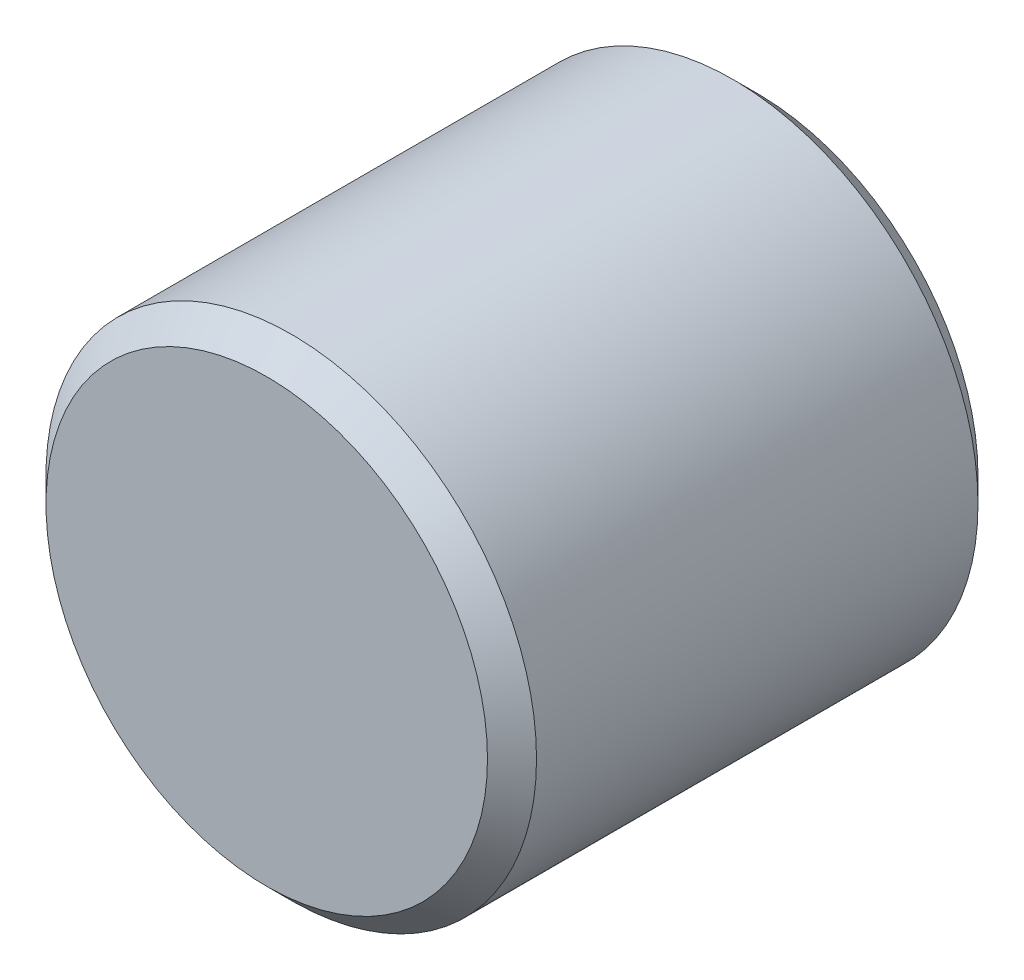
ISO-10303-21;
HEADER;
FILE_DESCRIPTION(('STEP AP214'),'2;1');
FILE_NAME('part.step','',(''),(''),'','','');
FILE_SCHEMA(('AUTOMOTIVE_DESIGN { 1 0 10303 214 1 1 1 1 }'));
ENDSEC;
DATA;
#1=APPLICATION_CONTEXT('core data for automotive mechanical design processes');
#2=APPLICATION_PROTOCOL_DEFINITION('international standard','automotive_design',2000,#1);
#3=PRODUCT_CONTEXT('',#1,'mechanical');
#4=PRODUCT('Part','Part','',(#3));
#5=PRODUCT_RELATED_PRODUCT_CATEGORY('part','',(#4));
#6=PRODUCT_DEFINITION_FORMATION('','',#4);
#7=PRODUCT_DEFINITION_CONTEXT('part definition',#1,'design');
#8=PRODUCT_DEFINITION('design','',#6,#7);
#9=PRODUCT_DEFINITION_SHAPE('','',#8);
#10=(LENGTH_UNIT() NAMED_UNIT(*) SI_UNIT(.MILLI.,.METRE.));
#11=(NAMED_UNIT(*) PLANE_ANGLE_UNIT() SI_UNIT($,.RADIAN.));
#12=(NAMED_UNIT(*) SI_UNIT($,.STERADIAN.) SOLID_ANGLE_UNIT());
#13=UNCERTAINTY_MEASURE_WITH_UNIT(LENGTH_MEASURE(1.E-05),#10,'distance_accuracy_value','');
#14=(GEOMETRIC_REPRESENTATION_CONTEXT(3) GLOBAL_UNCERTAINTY_ASSIGNED_CONTEXT((#13)) GLOBAL_UNIT_ASSIGNED_CONTEXT((#10,
#11,#12)) REPRESENTATION_CONTEXT('',''));
#15=CARTESIAN_POINT('',(0.,0.,0.));
#16=DIRECTION('',(0.,0.,1.));
#17=DIRECTION('',(1.,0.,0.));
#18=AXIS2_PLACEMENT_3D('',#15,#16,#17);
#19=CARTESIAN_POINT('',(0.,0.,50.8));
#20=DIRECTION('',(0.,0.,-1.));
#21=DIRECTION('',(-1.,0.,0.));
#22=AXIS2_PLACEMENT_3D('',#19,#20,#21);
#23=CYLINDRICAL_SURFACE('',#22,25.4);
#24=CARTESIAN_POINT('',(0.,0.,2.53999999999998));
#25=DIRECTION('',(0.,0.,1.));
#26=DIRECTION('',(1.,0.,0.));
#27=AXIS2_PLACEMENT_3D('',#24,#25,#26);
#28=CIRCLE('',#27,25.4);
#29=CARTESIAN_POINT('',(25.4,0.,2.53999999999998));
#30=VERTEX_POINT('',#29);
#31=EDGE_CURVE('E40',#30,#30,#28,.T.);
#32=ORIENTED_EDGE('',*,*,#31,.T.);
#33=EDGE_LOOP('',(#32));
#34=FACE_BOUND('',#33,.T.);
#35=CARTESIAN_POINT('',(0.,0.,48.26));
#36=DIRECTION('',(0.,0.,1.));
#37=DIRECTION('',(1.,0.,0.));
#38=AXIS2_PLACEMENT_3D('',#35,#36,#37);
#39=CIRCLE('',#38,25.4);
#40=CARTESIAN_POINT('',(25.4,0.,48.26));
#41=VERTEX_POINT('',#40);
#42=EDGE_CURVE('E44',#41,#41,#39,.F.);
#43=ORIENTED_EDGE('',*,*,#42,.T.);
#44=EDGE_LOOP('',(#43));
#45=FACE_BOUND('',#44,.T.);
#46=ADVANCED_FACE('F30',(#34,#45),#23,.T.);
#47=CARTESIAN_POINT('',(0.,0.,50.8));
#48=DIRECTION('',(0.,0.,1.));
#49=DIRECTION('',(1.,0.,0.));
#50=AXIS2_PLACEMENT_3D('',#47,#48,#49);
#51=PLANE('',#50);
#52=CARTESIAN_POINT('',(0.,0.,50.8));
#53=DIRECTION('',(0.,0.,1.));
#54=DIRECTION('',(1.,0.,0.));
#55=AXIS2_PLACEMENT_3D('',#52,#53,#54);
#56=CIRCLE('',#55,22.86);
#57=CARTESIAN_POINT('',(22.86,0.,50.8));
#58=VERTEX_POINT('',#57);
#59=EDGE_CURVE('E10',#58,#58,#56,.T.);
#60=ORIENTED_EDGE('',*,*,#59,.T.);
#61=EDGE_LOOP('',(#60));
#62=FACE_BOUND('',#61,.T.);
#63=ADVANCED_FACE('F63',(#62),#51,.T.);
#64=CARTESIAN_POINT('',(0.,0.,0.));
#65=DIRECTION('',(0.,0.,1.));
#66=DIRECTION('',(1.,0.,0.));
#67=AXIS2_PLACEMENT_3D('',#64,#65,#66);
#68=PLANE('',#67);
#69=CARTESIAN_POINT('',(0.,0.,0.));
#70=DIRECTION('',(0.,0.,1.));
#71=DIRECTION('',(1.,0.,0.));
#72=AXIS2_PLACEMENT_3D('',#69,#70,#71);
#73=CIRCLE('',#72,22.86);
#74=CARTESIAN_POINT('',(22.86,0.,0.));
#75=VERTEX_POINT('',#74);
#76=EDGE_CURVE('E36',#75,#75,#73,.F.);
#77=ORIENTED_EDGE('',*,*,#76,.T.);
#78=EDGE_LOOP('',(#77));
#79=FACE_BOUND('',#78,.T.);
#80=ADVANCED_FACE('F59',(#79),#68,.F.);
#81=CARTESIAN_POINT('',(0.,0.,2.53999999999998));
#82=DIRECTION('',(0.,0.,1.));
#83=DIRECTION('',(1.,0.,0.));
#84=AXIS2_PLACEMENT_3D('',#81,#82,#83);
#85=CONICAL_SURFACE('',#84,25.4,0.785398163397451);
#86=ORIENTED_EDGE('',*,*,#76,.F.);
#87=EDGE_LOOP('',(#86));
#88=FACE_BOUND('',#87,.T.);
#89=ORIENTED_EDGE('',*,*,#31,.F.);
#90=EDGE_LOOP('',(#89));
#91=FACE_BOUND('',#90,.T.);
#92=ADVANCED_FACE('F54',(#88,#91),#85,.T.);
#93=CARTESIAN_POINT('',(0.,0.,50.8));
#94=DIRECTION('',(0.,0.,-1.));
#95=DIRECTION('',(-1.,0.,0.));
#96=AXIS2_PLACEMENT_3D('',#93,#94,#95);
#97=CONICAL_SURFACE('',#96,22.86,0.785398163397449);
#98=ORIENTED_EDGE('',*,*,#42,.F.);
#99=EDGE_LOOP('',(#98));
#100=FACE_BOUND('',#99,.T.);
#101=ORIENTED_EDGE('',*,*,#59,.F.);
#102=EDGE_LOOP('',(#101));
#103=FACE_BOUND('',#102,.T.);
#104=ADVANCED_FACE('F51',(#100,#103),#97,.T.);
#105=CLOSED_SHELL('',(#46,#63,#80,#92,#104));
#106=MANIFOLD_SOLID_BREP('B2',#105);
#107=ADVANCED_BREP_SHAPE_REPRESENTATION('',(#18,#106),#14);
#108=SHAPE_DEFINITION_REPRESENTATION(#9,#107);
ENDSEC;
END-ISO-10303-21;
